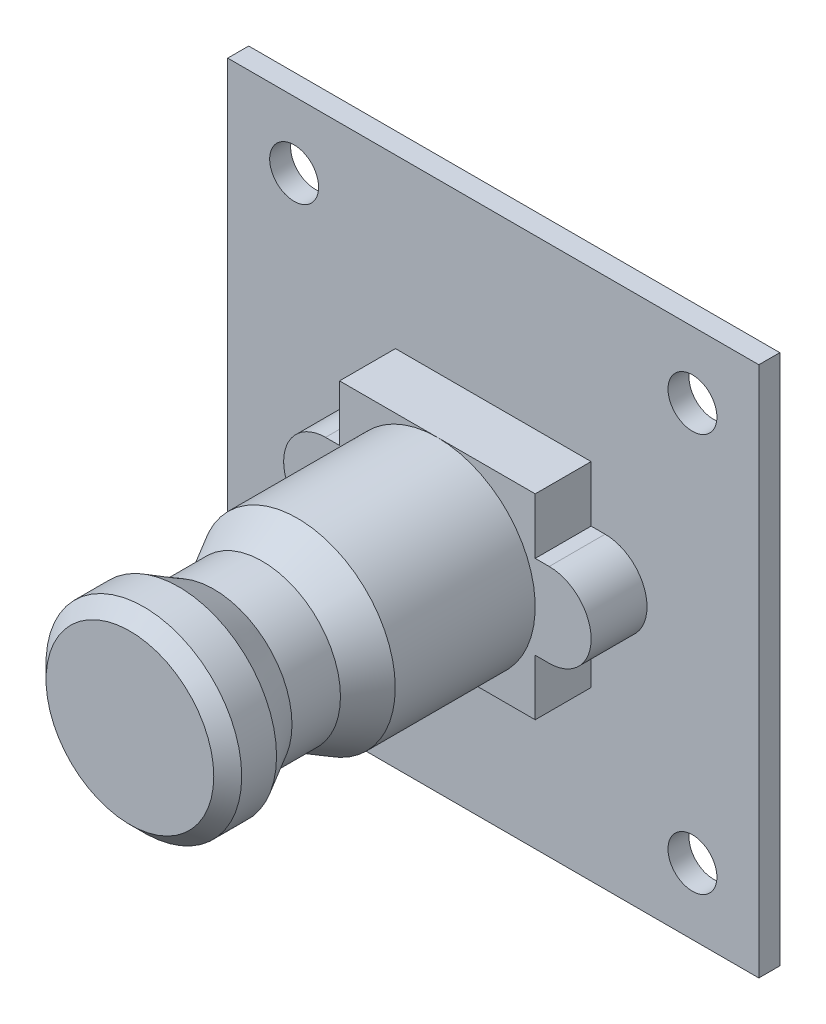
ISO-10303-21;
HEADER;
FILE_DESCRIPTION(('STEP AP214'),'2;1');
FILE_NAME('part.step','',(''),(''),'','','');
FILE_SCHEMA(('AUTOMOTIVE_DESIGN { 1 0 10303 214 1 1 1 1 }'));
ENDSEC;
DATA;
#1=APPLICATION_CONTEXT('core data for automotive mechanical design processes');
#2=APPLICATION_PROTOCOL_DEFINITION('international standard','automotive_design',2000,#1);
#3=PRODUCT_CONTEXT('',#1,'mechanical');
#4=PRODUCT('Part','Part','',(#3));
#5=PRODUCT_RELATED_PRODUCT_CATEGORY('part','',(#4));
#6=PRODUCT_DEFINITION_FORMATION('','',#4);
#7=PRODUCT_DEFINITION_CONTEXT('part definition',#1,'design');
#8=PRODUCT_DEFINITION('design','',#6,#7);
#9=PRODUCT_DEFINITION_SHAPE('','',#8);
#10=(LENGTH_UNIT() NAMED_UNIT(*) SI_UNIT(.MILLI.,.METRE.));
#11=(NAMED_UNIT(*) PLANE_ANGLE_UNIT() SI_UNIT($,.RADIAN.));
#12=(NAMED_UNIT(*) SI_UNIT($,.STERADIAN.) SOLID_ANGLE_UNIT());
#13=UNCERTAINTY_MEASURE_WITH_UNIT(LENGTH_MEASURE(1.E-05),#10,'distance_accuracy_value','');
#14=(GEOMETRIC_REPRESENTATION_CONTEXT(3) GLOBAL_UNCERTAINTY_ASSIGNED_CONTEXT((#13)) GLOBAL_UNIT_ASSIGNED_CONTEXT((#10,
#11,#12)) REPRESENTATION_CONTEXT('',''));
#15=CARTESIAN_POINT('',(0.,0.,0.));
#16=DIRECTION('',(0.,0.,1.));
#17=DIRECTION('',(1.,0.,0.));
#18=AXIS2_PLACEMENT_3D('',#15,#16,#17);
#19=CARTESIAN_POINT('',(0.,0.,0.));
#20=DIRECTION('',(0.,0.,1.));
#21=DIRECTION('',(1.,0.,0.));
#22=AXIS2_PLACEMENT_3D('',#19,#20,#21);
#23=PLANE('',#22);
#24=DIRECTION('',(0.,1.,0.));
#25=VECTOR('',#24,1.);
#26=CARTESIAN_POINT('',(19.,19.,0.));
#27=LINE('',#26,#25);
#28=CARTESIAN_POINT('',(19.,-19.,0.));
#29=VERTEX_POINT('',#28);
#30=CARTESIAN_POINT('',(19.,19.,0.));
#31=VERTEX_POINT('',#30);
#32=EDGE_CURVE('E329',#29,#31,#27,.T.);
#33=ORIENTED_EDGE('',*,*,#32,.F.);
#34=DIRECTION('',(1.,0.,0.));
#35=VECTOR('',#34,1.);
#36=CARTESIAN_POINT('',(-19.,-19.,0.));
#37=LINE('',#36,#35);
#38=CARTESIAN_POINT('',(-19.,-19.,0.));
#39=VERTEX_POINT('',#38);
#40=EDGE_CURVE('E334',#39,#29,#37,.T.);
#41=ORIENTED_EDGE('',*,*,#40,.F.);
#42=DIRECTION('',(0.,-1.,0.));
#43=VECTOR('',#42,1.);
#44=CARTESIAN_POINT('',(-19.,19.,0.));
#45=LINE('',#44,#43);
#46=CARTESIAN_POINT('',(-19.,19.,0.));
#47=VERTEX_POINT('',#46);
#48=EDGE_CURVE('E345',#47,#39,#45,.T.);
#49=ORIENTED_EDGE('',*,*,#48,.F.);
#50=DIRECTION('',(-1.,0.,0.));
#51=VECTOR('',#50,1.);
#52=CARTESIAN_POINT('',(-19.,19.,0.));
#53=LINE('',#52,#51);
#54=EDGE_CURVE('E343',#31,#47,#53,.T.);
#55=ORIENTED_EDGE('',*,*,#54,.F.);
#56=EDGE_LOOP('',(#33,#41,#49,#55));
#57=FACE_BOUND('',#56,.T.);
#58=CARTESIAN_POINT('',(-14.25,-14.25,0.));
#59=DIRECTION('',(0.,0.,1.));
#60=DIRECTION('',(1.,0.,0.));
#61=AXIS2_PLACEMENT_3D('',#58,#59,#60);
#62=CIRCLE('',#61,1.75);
#63=CARTESIAN_POINT('',(-12.5,-14.25,0.));
#64=VERTEX_POINT('',#63);
#65=EDGE_CURVE('E326',#64,#64,#62,.T.);
#66=ORIENTED_EDGE('',*,*,#65,.T.);
#67=EDGE_LOOP('',(#66));
#68=FACE_BOUND('',#67,.T.);
#69=CARTESIAN_POINT('',(14.25,-14.25,0.));
#70=DIRECTION('',(0.,0.,1.));
#71=DIRECTION('',(1.,0.,0.));
#72=AXIS2_PLACEMENT_3D('',#69,#70,#71);
#73=CIRCLE('',#72,1.75);
#74=CARTESIAN_POINT('',(16.,-14.25,0.));
#75=VERTEX_POINT('',#74);
#76=EDGE_CURVE('E320',#75,#75,#73,.T.);
#77=ORIENTED_EDGE('',*,*,#76,.T.);
#78=EDGE_LOOP('',(#77));
#79=FACE_BOUND('',#78,.T.);
#80=CARTESIAN_POINT('',(14.25,14.25,0.));
#81=DIRECTION('',(0.,0.,1.));
#82=DIRECTION('',(1.,0.,0.));
#83=AXIS2_PLACEMENT_3D('',#80,#81,#82);
#84=CIRCLE('',#83,1.75);
#85=CARTESIAN_POINT('',(16.,14.25,0.));
#86=VERTEX_POINT('',#85);
#87=EDGE_CURVE('E314',#86,#86,#84,.T.);
#88=ORIENTED_EDGE('',*,*,#87,.T.);
#89=EDGE_LOOP('',(#88));
#90=FACE_BOUND('',#89,.T.);
#91=CARTESIAN_POINT('',(-14.25,14.25,0.));
#92=DIRECTION('',(0.,0.,1.));
#93=DIRECTION('',(1.,0.,0.));
#94=AXIS2_PLACEMENT_3D('',#91,#92,#93);
#95=CIRCLE('',#94,1.75);
#96=CARTESIAN_POINT('',(-12.5,14.25,0.));
#97=VERTEX_POINT('',#96);
#98=EDGE_CURVE('E308',#97,#97,#95,.T.);
#99=ORIENTED_EDGE('',*,*,#98,.T.);
#100=EDGE_LOOP('',(#99));
#101=FACE_BOUND('',#100,.T.);
#102=DIRECTION('',(0.,1.,0.));
#103=VECTOR('',#102,1.);
#104=CARTESIAN_POINT('',(0.,-10.,0.));
#105=LINE('',#104,#103);
#106=CARTESIAN_POINT('',(0.,-16.,0.));
#107=VERTEX_POINT('',#106);
#108=CARTESIAN_POINT('',(0.,-10.,0.));
#109=VERTEX_POINT('',#108);
#110=EDGE_CURVE('E198',#107,#109,#105,.T.);
#111=ORIENTED_EDGE('',*,*,#110,.F.);
#112=DIRECTION('',(-1.,0.,0.));
#113=VECTOR('',#112,1.);
#114=CARTESIAN_POINT('',(10.,-16.,0.));
#115=LINE('',#114,#113);
#116=CARTESIAN_POINT('',(10.,-16.,0.));
#117=VERTEX_POINT('',#116);
#118=EDGE_CURVE('E195',#117,#107,#115,.T.);
#119=ORIENTED_EDGE('',*,*,#118,.F.);
#120=DIRECTION('',(0.,-1.,0.));
#121=VECTOR('',#120,1.);
#122=CARTESIAN_POINT('',(10.,-10.,0.));
#123=LINE('',#122,#121);
#124=CARTESIAN_POINT('',(10.,-10.,0.));
#125=VERTEX_POINT('',#124);
#126=EDGE_CURVE('E55',#125,#117,#123,.T.);
#127=ORIENTED_EDGE('',*,*,#126,.F.);
#128=DIRECTION('',(1.,0.,0.));
#129=VECTOR('',#128,1.);
#130=CARTESIAN_POINT('',(10.,-10.,0.));
#131=LINE('',#130,#129);
#132=EDGE_CURVE('E50',#109,#125,#131,.T.);
#133=ORIENTED_EDGE('',*,*,#132,.F.);
#134=EDGE_LOOP('',(#111,#119,#127,#133));
#135=FACE_BOUND('',#134,.T.);
#136=ADVANCED_FACE('F35',(#57,#68,#79,#90,#101,#135),#23,.F.);
#137=CARTESIAN_POINT('',(0.,0.,5.5));
#138=DIRECTION('',(0.,0.,1.));
#139=DIRECTION('',(1.,0.,0.));
#140=AXIS2_PLACEMENT_3D('',#137,#138,#139);
#141=PLANE('',#140);
#142=CARTESIAN_POINT('',(0.,0.,5.5));
#143=DIRECTION('',(0.,0.,1.));
#144=DIRECTION('',(1.,0.,0.));
#145=AXIS2_PLACEMENT_3D('',#142,#143,#144);
#146=CIRCLE('',#145,7.);
#147=CARTESIAN_POINT('',(0.,7.,5.5));
#148=VERTEX_POINT('',#147);
#149=CARTESIAN_POINT('',(0.,-7.,5.5));
#150=VERTEX_POINT('',#149);
#151=EDGE_CURVE('E216',#148,#150,#146,.T.);
#152=ORIENTED_EDGE('',*,*,#151,.F.);
#153=DIRECTION('',(-1.,0.,0.));
#154=VECTOR('',#153,1.);
#155=CARTESIAN_POINT('',(-7.,7.,5.5));
#156=LINE('',#155,#154);
#157=CARTESIAN_POINT('',(-7.,7.,5.5));
#158=VERTEX_POINT('',#157);
#159=EDGE_CURVE('E270',#148,#158,#156,.T.);
#160=ORIENTED_EDGE('',*,*,#159,.T.);
#161=DIRECTION('',(0.,-1.,0.));
#162=VECTOR('',#161,1.);
#163=CARTESIAN_POINT('',(-7.,7.,5.5));
#164=LINE('',#163,#162);
#165=CARTESIAN_POINT('',(-7.,3.,5.5));
#166=VERTEX_POINT('',#165);
#167=EDGE_CURVE('E275',#158,#166,#164,.T.);
#168=ORIENTED_EDGE('',*,*,#167,.T.);
#169=DIRECTION('',(-1.,0.,0.));
#170=VECTOR('',#169,1.);
#171=CARTESIAN_POINT('',(-8.,3.,5.5));
#172=LINE('',#171,#170);
#173=CARTESIAN_POINT('',(-8.,3.,5.5));
#174=VERTEX_POINT('',#173);
#175=EDGE_CURVE('E243',#166,#174,#172,.T.);
#176=ORIENTED_EDGE('',*,*,#175,.T.);
#177=CARTESIAN_POINT('',(-8.,0.,5.5));
#178=DIRECTION('',(0.,0.,1.));
#179=DIRECTION('',(1.,0.,0.));
#180=AXIS2_PLACEMENT_3D('',#177,#178,#179);
#181=CIRCLE('',#180,3.);
#182=CARTESIAN_POINT('',(-8.,-3.,5.5));
#183=VERTEX_POINT('',#182);
#184=EDGE_CURVE('E219',#174,#183,#181,.T.);
#185=ORIENTED_EDGE('',*,*,#184,.T.);
#186=DIRECTION('',(1.,0.,0.));
#187=VECTOR('',#186,1.);
#188=CARTESIAN_POINT('',(-8.,-3.,5.5));
#189=LINE('',#188,#187);
#190=CARTESIAN_POINT('',(-7.,-3.,5.5));
#191=VERTEX_POINT('',#190);
#192=EDGE_CURVE('E238',#183,#191,#189,.T.);
#193=ORIENTED_EDGE('',*,*,#192,.T.);
#194=CARTESIAN_POINT('',(-7.,-7.,5.5));
#195=VERTEX_POINT('',#194);
#196=EDGE_CURVE('E274',#191,#195,#164,.T.);
#197=ORIENTED_EDGE('',*,*,#196,.T.);
#198=DIRECTION('',(1.,0.,0.));
#199=VECTOR('',#198,1.);
#200=CARTESIAN_POINT('',(-7.,-7.,5.5));
#201=LINE('',#200,#199);
#202=EDGE_CURVE('E279',#195,#150,#201,.T.);
#203=ORIENTED_EDGE('',*,*,#202,.T.);
#204=EDGE_LOOP('',(#152,#160,#168,#176,#185,#193,#197,#203));
#205=FACE_BOUND('',#204,.T.);
#206=ADVANCED_FACE('F376',(#205),#141,.T.);
#207=CARTESIAN_POINT('',(7.,7.,5.5));
#208=DIRECTION('',(-1.,0.,0.));
#209=DIRECTION('',(0.,-1.,0.));
#210=AXIS2_PLACEMENT_3D('',#207,#208,#209);
#211=PLANE('',#210);
#212=DIRECTION('',(0.,1.,0.));
#213=VECTOR('',#212,1.);
#214=CARTESIAN_POINT('',(7.,7.,5.5));
#215=LINE('',#214,#213);
#216=CARTESIAN_POINT('',(7.,3.,5.5));
#217=VERTEX_POINT('',#216);
#218=CARTESIAN_POINT('',(7.,7.,5.5));
#219=VERTEX_POINT('',#218);
#220=EDGE_CURVE('E271',#217,#219,#215,.T.);
#221=ORIENTED_EDGE('',*,*,#220,.F.);
#222=DIRECTION('',(0.,0.,-1.));
#223=VECTOR('',#222,1.);
#224=CARTESIAN_POINT('',(7.,3.,5.5));
#225=LINE('',#224,#223);
#226=CARTESIAN_POINT('',(7.,3.,1.5));
#227=VERTEX_POINT('',#226);
#228=EDGE_CURVE('E263',#217,#227,#225,.T.);
#229=ORIENTED_EDGE('',*,*,#228,.T.);
#230=DIRECTION('',(0.,1.,0.));
#231=VECTOR('',#230,1.);
#232=CARTESIAN_POINT('',(7.,7.,1.5));
#233=LINE('',#232,#231);
#234=CARTESIAN_POINT('',(7.,7.,1.5));
#235=VERTEX_POINT('',#234);
#236=EDGE_CURVE('E266',#227,#235,#233,.T.);
#237=ORIENTED_EDGE('',*,*,#236,.T.);
#238=DIRECTION('',(0.,0.,-1.));
#239=VECTOR('',#238,1.);
#240=CARTESIAN_POINT('',(7.,7.,5.5));
#241=LINE('',#240,#239);
#242=EDGE_CURVE('E302',#219,#235,#241,.T.);
#243=ORIENTED_EDGE('',*,*,#242,.F.);
#244=EDGE_LOOP('',(#221,#229,#237,#243));
#245=FACE_BOUND('',#244,.T.);
#246=ADVANCED_FACE('F413',(#245),#211,.F.);
#247=CARTESIAN_POINT('',(-7.,7.,5.5));
#248=DIRECTION('',(1.,0.,0.));
#249=DIRECTION('',(0.,1.,0.));
#250=AXIS2_PLACEMENT_3D('',#247,#248,#249);
#251=PLANE('',#250);
#252=DIRECTION('',(0.,-1.,0.));
#253=VECTOR('',#252,1.);
#254=CARTESIAN_POINT('',(-7.,7.,1.5));
#255=LINE('',#254,#253);
#256=CARTESIAN_POINT('',(-7.,7.,1.5));
#257=VERTEX_POINT('',#256);
#258=CARTESIAN_POINT('',(-7.,3.,1.5));
#259=VERTEX_POINT('',#258);
#260=EDGE_CURVE('E289',#257,#259,#255,.T.);
#261=ORIENTED_EDGE('',*,*,#260,.T.);
#262=DIRECTION('',(0.,0.,1.));
#263=VECTOR('',#262,1.);
#264=CARTESIAN_POINT('',(-7.,3.,5.5));
#265=LINE('',#264,#263);
#266=EDGE_CURVE('E260',#259,#166,#265,.T.);
#267=ORIENTED_EDGE('',*,*,#266,.T.);
#268=ORIENTED_EDGE('',*,*,#167,.F.);
#269=DIRECTION('',(0.,0.,-1.));
#270=VECTOR('',#269,1.);
#271=CARTESIAN_POINT('',(-7.,7.,5.5));
#272=LINE('',#271,#270);
#273=EDGE_CURVE('E299',#158,#257,#272,.T.);
#274=ORIENTED_EDGE('',*,*,#273,.T.);
#275=EDGE_LOOP('',(#261,#267,#268,#274));
#276=FACE_BOUND('',#275,.T.);
#277=ADVANCED_FACE('F418',(#276),#251,.F.);
#278=CARTESIAN_POINT('',(0.,0.,1.5));
#279=DIRECTION('',(0.,0.,1.));
#280=DIRECTION('',(1.,0.,0.));
#281=AXIS2_PLACEMENT_3D('',#278,#279,#280);
#282=PLANE('',#281);
#283=DIRECTION('',(-1.,0.,0.));
#284=VECTOR('',#283,1.);
#285=CARTESIAN_POINT('',(-8.,3.,1.5));
#286=LINE('',#285,#284);
#287=CARTESIAN_POINT('',(-8.,3.,1.5));
#288=VERTEX_POINT('',#287);
#289=EDGE_CURVE('E231',#259,#288,#286,.T.);
#290=ORIENTED_EDGE('',*,*,#289,.F.);
#291=ORIENTED_EDGE('',*,*,#260,.F.);
#292=DIRECTION('',(-1.,0.,0.));
#293=VECTOR('',#292,1.);
#294=CARTESIAN_POINT('',(-7.,7.,1.5));
#295=LINE('',#294,#293);
#296=EDGE_CURVE('E286',#235,#257,#295,.T.);
#297=ORIENTED_EDGE('',*,*,#296,.F.);
#298=ORIENTED_EDGE('',*,*,#236,.F.);
#299=CARTESIAN_POINT('',(8.,3.,1.5));
#300=VERTEX_POINT('',#299);
#301=EDGE_CURVE('E232',#300,#227,#286,.T.);
#302=ORIENTED_EDGE('',*,*,#301,.F.);
#303=CARTESIAN_POINT('',(8.,0.,1.5));
#304=DIRECTION('',(0.,0.,1.));
#305=DIRECTION('',(1.,0.,0.));
#306=AXIS2_PLACEMENT_3D('',#303,#304,#305);
#307=CIRCLE('',#306,3.);
#308=CARTESIAN_POINT('',(8.,-3.,1.5));
#309=VERTEX_POINT('',#308);
#310=EDGE_CURVE('E228',#309,#300,#307,.T.);
#311=ORIENTED_EDGE('',*,*,#310,.F.);
#312=DIRECTION('',(1.,0.,0.));
#313=VECTOR('',#312,1.);
#314=CARTESIAN_POINT('',(-8.,-3.,1.5));
#315=LINE('',#314,#313);
#316=CARTESIAN_POINT('',(7.,-3.,1.5));
#317=VERTEX_POINT('',#316);
#318=EDGE_CURVE('E224',#317,#309,#315,.T.);
#319=ORIENTED_EDGE('',*,*,#318,.F.);
#320=CARTESIAN_POINT('',(7.,-7.,1.5));
#321=VERTEX_POINT('',#320);
#322=EDGE_CURVE('E283',#321,#317,#233,.T.);
#323=ORIENTED_EDGE('',*,*,#322,.F.);
#324=DIRECTION('',(1.,0.,0.));
#325=VECTOR('',#324,1.);
#326=CARTESIAN_POINT('',(-7.,-7.,1.5));
#327=LINE('',#326,#325);
#328=CARTESIAN_POINT('',(-7.,-7.,1.5));
#329=VERTEX_POINT('',#328);
#330=EDGE_CURVE('E292',#329,#321,#327,.T.);
#331=ORIENTED_EDGE('',*,*,#330,.F.);
#332=CARTESIAN_POINT('',(-7.,-3.,1.5));
#333=VERTEX_POINT('',#332);
#334=EDGE_CURVE('E288',#333,#329,#255,.T.);
#335=ORIENTED_EDGE('',*,*,#334,.F.);
#336=CARTESIAN_POINT('',(-8.,-3.,1.5));
#337=VERTEX_POINT('',#336);
#338=EDGE_CURVE('E226',#337,#333,#315,.T.);
#339=ORIENTED_EDGE('',*,*,#338,.F.);
#340=CARTESIAN_POINT('',(-8.,0.,1.5));
#341=DIRECTION('',(0.,0.,1.));
#342=DIRECTION('',(1.,0.,0.));
#343=AXIS2_PLACEMENT_3D('',#340,#341,#342);
#344=CIRCLE('',#343,3.);
#345=EDGE_CURVE('E221',#288,#337,#344,.T.);
#346=ORIENTED_EDGE('',*,*,#345,.F.);
#347=EDGE_LOOP('',(#290,#291,#297,#298,#302,#311,#319,#323,#331,#335,#339,#346));
#348=FACE_BOUND('',#347,.T.);
#349=CARTESIAN_POINT('',(-14.25,14.25,1.5));
#350=DIRECTION('',(0.,0.,1.));
#351=DIRECTION('',(1.,0.,0.));
#352=AXIS2_PLACEMENT_3D('',#349,#350,#351);
#353=CIRCLE('',#352,1.75);
#354=CARTESIAN_POINT('',(-12.5,14.25,1.5));
#355=VERTEX_POINT('',#354);
#356=EDGE_CURVE('E305',#355,#355,#353,.T.);
#357=ORIENTED_EDGE('',*,*,#356,.F.);
#358=EDGE_LOOP('',(#357));
#359=FACE_BOUND('',#358,.T.);
#360=CARTESIAN_POINT('',(14.25,14.25,1.5));
#361=DIRECTION('',(0.,0.,1.));
#362=DIRECTION('',(1.,0.,0.));
#363=AXIS2_PLACEMENT_3D('',#360,#361,#362);
#364=CIRCLE('',#363,1.75);
#365=CARTESIAN_POINT('',(16.,14.25,1.5));
#366=VERTEX_POINT('',#365);
#367=EDGE_CURVE('E311',#366,#366,#364,.T.);
#368=ORIENTED_EDGE('',*,*,#367,.F.);
#369=EDGE_LOOP('',(#368));
#370=FACE_BOUND('',#369,.T.);
#371=CARTESIAN_POINT('',(14.25,-14.25,1.5));
#372=DIRECTION('',(0.,0.,1.));
#373=DIRECTION('',(1.,0.,0.));
#374=AXIS2_PLACEMENT_3D('',#371,#372,#373);
#375=CIRCLE('',#374,1.75);
#376=CARTESIAN_POINT('',(16.,-14.25,1.5));
#377=VERTEX_POINT('',#376);
#378=EDGE_CURVE('E317',#377,#377,#375,.T.);
#379=ORIENTED_EDGE('',*,*,#378,.F.);
#380=EDGE_LOOP('',(#379));
#381=FACE_BOUND('',#380,.T.);
#382=CARTESIAN_POINT('',(-14.25,-14.25,1.5));
#383=DIRECTION('',(0.,0.,1.));
#384=DIRECTION('',(1.,0.,0.));
#385=AXIS2_PLACEMENT_3D('',#382,#383,#384);
#386=CIRCLE('',#385,1.75);
#387=CARTESIAN_POINT('',(-12.5,-14.25,1.5));
#388=VERTEX_POINT('',#387);
#389=EDGE_CURVE('E323',#388,#388,#386,.T.);
#390=ORIENTED_EDGE('',*,*,#389,.F.);
#391=EDGE_LOOP('',(#390));
#392=FACE_BOUND('',#391,.T.);
#393=DIRECTION('',(0.,1.,0.));
#394=VECTOR('',#393,1.);
#395=CARTESIAN_POINT('',(19.,19.,1.5));
#396=LINE('',#395,#394);
#397=CARTESIAN_POINT('',(19.,-19.,1.5));
#398=VERTEX_POINT('',#397);
#399=CARTESIAN_POINT('',(19.,19.,1.5));
#400=VERTEX_POINT('',#399);
#401=EDGE_CURVE('E330',#398,#400,#396,.T.);
#402=ORIENTED_EDGE('',*,*,#401,.T.);
#403=DIRECTION('',(-1.,0.,0.));
#404=VECTOR('',#403,1.);
#405=CARTESIAN_POINT('',(-19.,19.,1.5));
#406=LINE('',#405,#404);
#407=CARTESIAN_POINT('',(-19.,19.,1.5));
#408=VERTEX_POINT('',#407);
#409=EDGE_CURVE('E333',#400,#408,#406,.T.);
#410=ORIENTED_EDGE('',*,*,#409,.T.);
#411=DIRECTION('',(0.,-1.,0.));
#412=VECTOR('',#411,1.);
#413=CARTESIAN_POINT('',(-19.,19.,1.5));
#414=LINE('',#413,#412);
#415=CARTESIAN_POINT('',(-19.,-19.,1.5));
#416=VERTEX_POINT('',#415);
#417=EDGE_CURVE('E336',#408,#416,#414,.T.);
#418=ORIENTED_EDGE('',*,*,#417,.T.);
#419=DIRECTION('',(1.,0.,0.));
#420=VECTOR('',#419,1.);
#421=CARTESIAN_POINT('',(-19.,-19.,1.5));
#422=LINE('',#421,#420);
#423=EDGE_CURVE('E338',#416,#398,#422,.T.);
#424=ORIENTED_EDGE('',*,*,#423,.T.);
#425=EDGE_LOOP('',(#402,#410,#418,#424));
#426=FACE_BOUND('',#425,.T.);
#427=ADVANCED_FACE('F388',(#348,#359,#370,#381,#392,#426),#282,.T.);
#428=CARTESIAN_POINT('',(19.,19.,1.5));
#429=DIRECTION('',(-1.,0.,0.));
#430=DIRECTION('',(0.,-1.,0.));
#431=AXIS2_PLACEMENT_3D('',#428,#429,#430);
#432=PLANE('',#431);
#433=ORIENTED_EDGE('',*,*,#32,.T.);
#434=DIRECTION('',(0.,0.,-1.));
#435=VECTOR('',#434,1.);
#436=CARTESIAN_POINT('',(19.,19.,1.5));
#437=LINE('',#436,#435);
#438=EDGE_CURVE('E356',#400,#31,#437,.T.);
#439=ORIENTED_EDGE('',*,*,#438,.F.);
#440=ORIENTED_EDGE('',*,*,#401,.F.);
#441=DIRECTION('',(0.,0.,-1.));
#442=VECTOR('',#441,1.);
#443=CARTESIAN_POINT('',(19.,-19.,1.5));
#444=LINE('',#443,#442);
#445=EDGE_CURVE('E340',#398,#29,#444,.T.);
#446=ORIENTED_EDGE('',*,*,#445,.T.);
#447=EDGE_LOOP('',(#433,#439,#440,#446));
#448=FACE_BOUND('',#447,.T.);
#449=ADVANCED_FACE('F463',(#448),#432,.F.);
#450=CARTESIAN_POINT('',(-19.,19.,1.5));
#451=DIRECTION('',(0.,-1.,0.));
#452=DIRECTION('',(0.,0.,-1.));
#453=AXIS2_PLACEMENT_3D('',#450,#451,#452);
#454=PLANE('',#453);
#455=ORIENTED_EDGE('',*,*,#54,.T.);
#456=DIRECTION('',(0.,0.,-1.));
#457=VECTOR('',#456,1.);
#458=CARTESIAN_POINT('',(-19.,19.,1.5));
#459=LINE('',#458,#457);
#460=EDGE_CURVE('E353',#408,#47,#459,.T.);
#461=ORIENTED_EDGE('',*,*,#460,.F.);
#462=ORIENTED_EDGE('',*,*,#409,.F.);
#463=ORIENTED_EDGE('',*,*,#438,.T.);
#464=EDGE_LOOP('',(#455,#461,#462,#463));
#465=FACE_BOUND('',#464,.T.);
#466=ADVANCED_FACE('F460',(#465),#454,.F.);
#467=CARTESIAN_POINT('',(-19.,19.,1.5));
#468=DIRECTION('',(1.,0.,0.));
#469=DIRECTION('',(0.,0.,-1.));
#470=AXIS2_PLACEMENT_3D('',#467,#468,#469);
#471=PLANE('',#470);
#472=ORIENTED_EDGE('',*,*,#48,.T.);
#473=DIRECTION('',(0.,0.,-1.));
#474=VECTOR('',#473,1.);
#475=CARTESIAN_POINT('',(-19.,-19.,1.5));
#476=LINE('',#475,#474);
#477=EDGE_CURVE('E350',#416,#39,#476,.T.);
#478=ORIENTED_EDGE('',*,*,#477,.F.);
#479=ORIENTED_EDGE('',*,*,#417,.F.);
#480=ORIENTED_EDGE('',*,*,#460,.T.);
#481=EDGE_LOOP('',(#472,#478,#479,#480));
#482=FACE_BOUND('',#481,.T.);
#483=ADVANCED_FACE('F456',(#482),#471,.F.);
#484=CARTESIAN_POINT('',(-19.,-19.,1.5));
#485=DIRECTION('',(0.,1.,0.));
#486=DIRECTION('',(0.,0.,1.));
#487=AXIS2_PLACEMENT_3D('',#484,#485,#486);
#488=PLANE('',#487);
#489=ORIENTED_EDGE('',*,*,#40,.T.);
#490=ORIENTED_EDGE('',*,*,#445,.F.);
#491=ORIENTED_EDGE('',*,*,#423,.F.);
#492=ORIENTED_EDGE('',*,*,#477,.T.);
#493=EDGE_LOOP('',(#489,#490,#491,#492));
#494=FACE_BOUND('',#493,.T.);
#495=ADVANCED_FACE('F452',(#494),#488,.F.);
#496=CARTESIAN_POINT('',(-14.25,-14.25,1.5));
#497=DIRECTION('',(0.,0.,1.));
#498=DIRECTION('',(1.,0.,0.));
#499=AXIS2_PLACEMENT_3D('',#496,#497,#498);
#500=CYLINDRICAL_SURFACE('',#499,1.75);
#501=ORIENTED_EDGE('',*,*,#389,.T.);
#502=EDGE_LOOP('',(#501));
#503=FACE_BOUND('',#502,.T.);
#504=ORIENTED_EDGE('',*,*,#65,.F.);
#505=EDGE_LOOP('',(#504));
#506=FACE_BOUND('',#505,.T.);
#507=ADVANCED_FACE('F455',(#503,#506),#500,.F.);
#508=CARTESIAN_POINT('',(14.25,-14.25,1.5));
#509=DIRECTION('',(0.,0.,1.));
#510=DIRECTION('',(1.,0.,0.));
#511=AXIS2_PLACEMENT_3D('',#508,#509,#510);
#512=CYLINDRICAL_SURFACE('',#511,1.75);
#513=ORIENTED_EDGE('',*,*,#378,.T.);
#514=EDGE_LOOP('',(#513));
#515=FACE_BOUND('',#514,.T.);
#516=ORIENTED_EDGE('',*,*,#76,.F.);
#517=EDGE_LOOP('',(#516));
#518=FACE_BOUND('',#517,.T.);
#519=ADVANCED_FACE('F506',(#515,#518),#512,.F.);
#520=CARTESIAN_POINT('',(14.25,14.25,1.5));
#521=DIRECTION('',(0.,0.,1.));
#522=DIRECTION('',(1.,0.,0.));
#523=AXIS2_PLACEMENT_3D('',#520,#521,#522);
#524=CYLINDRICAL_SURFACE('',#523,1.75);
#525=ORIENTED_EDGE('',*,*,#367,.T.);
#526=EDGE_LOOP('',(#525));
#527=FACE_BOUND('',#526,.T.);
#528=ORIENTED_EDGE('',*,*,#87,.F.);
#529=EDGE_LOOP('',(#528));
#530=FACE_BOUND('',#529,.T.);
#531=ADVANCED_FACE('F502',(#527,#530),#524,.F.);
#532=CARTESIAN_POINT('',(-14.25,14.25,1.5));
#533=DIRECTION('',(0.,0.,1.));
#534=DIRECTION('',(1.,0.,0.));
#535=AXIS2_PLACEMENT_3D('',#532,#533,#534);
#536=CYLINDRICAL_SURFACE('',#535,1.75);
#537=ORIENTED_EDGE('',*,*,#356,.T.);
#538=EDGE_LOOP('',(#537));
#539=FACE_BOUND('',#538,.T.);
#540=ORIENTED_EDGE('',*,*,#98,.F.);
#541=EDGE_LOOP('',(#540));
#542=FACE_BOUND('',#541,.T.);
#543=ADVANCED_FACE('F498',(#539,#542),#536,.F.);
#544=ORIENTED_EDGE('',*,*,#322,.T.);
#545=DIRECTION('',(0.,0.,1.));
#546=VECTOR('',#545,1.);
#547=CARTESIAN_POINT('',(7.,-3.,5.5));
#548=LINE('',#547,#546);
#549=CARTESIAN_POINT('',(7.,-3.,5.5));
#550=VERTEX_POINT('',#549);
#551=EDGE_CURVE('E257',#317,#550,#548,.T.);
#552=ORIENTED_EDGE('',*,*,#551,.T.);
#553=CARTESIAN_POINT('',(7.,-7.,5.5));
#554=VERTEX_POINT('',#553);
#555=EDGE_CURVE('E267',#554,#550,#215,.T.);
#556=ORIENTED_EDGE('',*,*,#555,.F.);
#557=DIRECTION('',(0.,0.,-1.));
#558=VECTOR('',#557,1.);
#559=CARTESIAN_POINT('',(7.,-7.,5.5));
#560=LINE('',#559,#558);
#561=EDGE_CURVE('E282',#554,#321,#560,.T.);
#562=ORIENTED_EDGE('',*,*,#561,.T.);
#563=EDGE_LOOP('',(#544,#552,#556,#562));
#564=FACE_BOUND('',#563,.T.);
#565=ADVANCED_FACE('F394',(#564),#211,.F.);
#566=CARTESIAN_POINT('',(-7.,7.,5.5));
#567=DIRECTION('',(0.,-1.,0.));
#568=DIRECTION('',(0.,0.,-1.));
#569=AXIS2_PLACEMENT_3D('',#566,#567,#568);
#570=PLANE('',#569);
#571=ORIENTED_EDGE('',*,*,#296,.T.);
#572=ORIENTED_EDGE('',*,*,#273,.F.);
#573=ORIENTED_EDGE('',*,*,#159,.F.);
#574=EDGE_CURVE('E272',#219,#148,#156,.T.);
#575=ORIENTED_EDGE('',*,*,#574,.F.);
#576=ORIENTED_EDGE('',*,*,#242,.T.);
#577=EDGE_LOOP('',(#571,#572,#573,#575,#576));
#578=FACE_BOUND('',#577,.T.);
#579=ADVANCED_FACE('F410',(#578),#570,.F.);
#580=ORIENTED_EDGE('',*,*,#196,.F.);
#581=DIRECTION('',(0.,0.,-1.));
#582=VECTOR('',#581,1.);
#583=CARTESIAN_POINT('',(-7.,-3.,5.5));
#584=LINE('',#583,#582);
#585=EDGE_CURVE('E248',#191,#333,#584,.T.);
#586=ORIENTED_EDGE('',*,*,#585,.T.);
#587=ORIENTED_EDGE('',*,*,#334,.T.);
#588=DIRECTION('',(0.,0.,-1.));
#589=VECTOR('',#588,1.);
#590=CARTESIAN_POINT('',(-7.,-7.,5.5));
#591=LINE('',#590,#589);
#592=EDGE_CURVE('E296',#195,#329,#591,.T.);
#593=ORIENTED_EDGE('',*,*,#592,.F.);
#594=EDGE_LOOP('',(#580,#586,#587,#593));
#595=FACE_BOUND('',#594,.T.);
#596=ADVANCED_FACE('F382',(#595),#251,.F.);
#597=CARTESIAN_POINT('',(-7.,-7.,5.5));
#598=DIRECTION('',(0.,1.,0.));
#599=DIRECTION('',(0.,0.,1.));
#600=AXIS2_PLACEMENT_3D('',#597,#598,#599);
#601=PLANE('',#600);
#602=ORIENTED_EDGE('',*,*,#330,.T.);
#603=ORIENTED_EDGE('',*,*,#561,.F.);
#604=EDGE_CURVE('E278',#150,#554,#201,.T.);
#605=ORIENTED_EDGE('',*,*,#604,.F.);
#606=ORIENTED_EDGE('',*,*,#202,.F.);
#607=ORIENTED_EDGE('',*,*,#592,.T.);
#608=EDGE_LOOP('',(#602,#603,#605,#606,#607));
#609=FACE_BOUND('',#608,.T.);
#610=ADVANCED_FACE('F373',(#609),#601,.F.);
#611=EDGE_CURVE('E220',#150,#148,#146,.T.);
#612=ORIENTED_EDGE('',*,*,#611,.F.);
#613=ORIENTED_EDGE('',*,*,#604,.T.);
#614=ORIENTED_EDGE('',*,*,#555,.T.);
#615=CARTESIAN_POINT('',(8.,-3.,5.5));
#616=VERTEX_POINT('',#615);
#617=EDGE_CURVE('E237',#550,#616,#189,.T.);
#618=ORIENTED_EDGE('',*,*,#617,.T.);
#619=CARTESIAN_POINT('',(8.,0.,5.5));
#620=DIRECTION('',(0.,0.,1.));
#621=DIRECTION('',(1.,0.,0.));
#622=AXIS2_PLACEMENT_3D('',#619,#620,#621);
#623=CIRCLE('',#622,3.);
#624=CARTESIAN_POINT('',(8.,3.,5.5));
#625=VERTEX_POINT('',#624);
#626=EDGE_CURVE('E240',#616,#625,#623,.T.);
#627=ORIENTED_EDGE('',*,*,#626,.T.);
#628=EDGE_CURVE('E225',#625,#217,#172,.T.);
#629=ORIENTED_EDGE('',*,*,#628,.T.);
#630=ORIENTED_EDGE('',*,*,#220,.T.);
#631=ORIENTED_EDGE('',*,*,#574,.T.);
#632=EDGE_LOOP('',(#612,#613,#614,#618,#627,#629,#630,#631));
#633=FACE_BOUND('',#632,.T.);
#634=ADVANCED_FACE('F367',(#633),#141,.T.);
#635=CARTESIAN_POINT('',(-8.,-3.,1.5));
#636=DIRECTION('',(0.,-1.,0.));
#637=DIRECTION('',(0.,0.,-1.));
#638=AXIS2_PLACEMENT_3D('',#635,#636,#637);
#639=PLANE('',#638);
#640=ORIENTED_EDGE('',*,*,#585,.F.);
#641=ORIENTED_EDGE('',*,*,#192,.F.);
#642=DIRECTION('',(0.,0.,1.));
#643=VECTOR('',#642,1.);
#644=CARTESIAN_POINT('',(-8.,-3.,1.5));
#645=LINE('',#644,#643);
#646=EDGE_CURVE('E234',#337,#183,#645,.T.);
#647=ORIENTED_EDGE('',*,*,#646,.F.);
#648=ORIENTED_EDGE('',*,*,#338,.T.);
#649=EDGE_LOOP('',(#640,#641,#647,#648));
#650=FACE_BOUND('',#649,.T.);
#651=ADVANCED_FACE('F427',(#650),#639,.T.);
#652=CARTESIAN_POINT('',(-8.,3.,1.5));
#653=DIRECTION('',(0.,1.,0.));
#654=DIRECTION('',(0.,0.,1.));
#655=AXIS2_PLACEMENT_3D('',#652,#653,#654);
#656=PLANE('',#655);
#657=ORIENTED_EDGE('',*,*,#266,.F.);
#658=ORIENTED_EDGE('',*,*,#289,.T.);
#659=DIRECTION('',(0.,0.,1.));
#660=VECTOR('',#659,1.);
#661=CARTESIAN_POINT('',(-8.,3.,1.5));
#662=LINE('',#661,#660);
#663=EDGE_CURVE('E245',#288,#174,#662,.T.);
#664=ORIENTED_EDGE('',*,*,#663,.T.);
#665=ORIENTED_EDGE('',*,*,#175,.F.);
#666=EDGE_LOOP('',(#657,#658,#664,#665));
#667=FACE_BOUND('',#666,.T.);
#668=ADVANCED_FACE('F422',(#667),#656,.T.);
#669=CARTESIAN_POINT('',(-8.,0.,1.5));
#670=DIRECTION('',(0.,0.,1.));
#671=DIRECTION('',(1.,0.,0.));
#672=AXIS2_PLACEMENT_3D('',#669,#670,#671);
#673=CYLINDRICAL_SURFACE('',#672,3.);
#674=ORIENTED_EDGE('',*,*,#184,.F.);
#675=ORIENTED_EDGE('',*,*,#663,.F.);
#676=ORIENTED_EDGE('',*,*,#345,.T.);
#677=ORIENTED_EDGE('',*,*,#646,.T.);
#678=EDGE_LOOP('',(#674,#675,#676,#677));
#679=FACE_BOUND('',#678,.T.);
#680=ADVANCED_FACE('F425',(#679),#673,.T.);
#681=ORIENTED_EDGE('',*,*,#228,.F.);
#682=ORIENTED_EDGE('',*,*,#628,.F.);
#683=DIRECTION('',(0.,0.,1.));
#684=VECTOR('',#683,1.);
#685=CARTESIAN_POINT('',(8.,3.,1.5));
#686=LINE('',#685,#684);
#687=EDGE_CURVE('E249',#300,#625,#686,.T.);
#688=ORIENTED_EDGE('',*,*,#687,.F.);
#689=ORIENTED_EDGE('',*,*,#301,.T.);
#690=EDGE_LOOP('',(#681,#682,#688,#689));
#691=FACE_BOUND('',#690,.T.);
#692=ADVANCED_FACE('F405',(#691),#656,.T.);
#693=ORIENTED_EDGE('',*,*,#551,.F.);
#694=ORIENTED_EDGE('',*,*,#318,.T.);
#695=DIRECTION('',(0.,0.,1.));
#696=VECTOR('',#695,1.);
#697=CARTESIAN_POINT('',(8.,-3.,1.5));
#698=LINE('',#697,#696);
#699=EDGE_CURVE('E251',#309,#616,#698,.T.);
#700=ORIENTED_EDGE('',*,*,#699,.T.);
#701=ORIENTED_EDGE('',*,*,#617,.F.);
#702=EDGE_LOOP('',(#693,#694,#700,#701));
#703=FACE_BOUND('',#702,.T.);
#704=ADVANCED_FACE('F399',(#703),#639,.T.);
#705=CARTESIAN_POINT('',(8.,0.,1.5));
#706=DIRECTION('',(0.,0.,1.));
#707=DIRECTION('',(1.,0.,0.));
#708=AXIS2_PLACEMENT_3D('',#705,#706,#707);
#709=CYLINDRICAL_SURFACE('',#708,3.);
#710=ORIENTED_EDGE('',*,*,#626,.F.);
#711=ORIENTED_EDGE('',*,*,#699,.F.);
#712=ORIENTED_EDGE('',*,*,#310,.T.);
#713=ORIENTED_EDGE('',*,*,#687,.T.);
#714=EDGE_LOOP('',(#710,#711,#712,#713));
#715=FACE_BOUND('',#714,.T.);
#716=ADVANCED_FACE('F401',(#715),#709,.T.);
#717=CARTESIAN_POINT('',(0.,0.,27.5));
#718=DIRECTION('',(0.,0.,-1.));
#719=DIRECTION('',(-1.,0.,0.));
#720=AXIS2_PLACEMENT_3D('',#717,#718,#719);
#721=CYLINDRICAL_SURFACE('',#720,7.);
#722=CARTESIAN_POINT('',(0.,0.,15.5142190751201));
#723=DIRECTION('',(0.,0.,1.));
#724=DIRECTION('',(1.,0.,0.));
#725=AXIS2_PLACEMENT_3D('',#722,#723,#724);
#726=CIRCLE('',#725,7.);
#727=CARTESIAN_POINT('',(7.,0.,15.5142190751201));
#728=VERTEX_POINT('',#727);
#729=EDGE_CURVE('E199',#728,#728,#726,.T.);
#730=ORIENTED_EDGE('',*,*,#729,.F.);
#731=EDGE_LOOP('',(#730));
#732=FACE_BOUND('',#731,.T.);
#733=ORIENTED_EDGE('',*,*,#151,.T.);
#734=ORIENTED_EDGE('',*,*,#611,.T.);
#735=EDGE_LOOP('',(#733,#734));
#736=FACE_BOUND('',#735,.T.);
#737=ADVANCED_FACE('F363',(#732,#736),#721,.T.);
#738=CARTESIAN_POINT('',(0.,0.,21.4946227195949));
#739=DIRECTION('',(0.,0.,1.));
#740=DIRECTION('',(1.,0.,0.));
#741=AXIS2_PLACEMENT_3D('',#738,#739,#740);
#742=CONICAL_SURFACE('',#741,5.59167740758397,0.511012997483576);
#743=CARTESIAN_POINT('',(0.,0.,24.0063922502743));
#744=DIRECTION('',(0.,0.,1.));
#745=DIRECTION('',(1.,0.,0.));
#746=AXIS2_PLACEMENT_3D('',#743,#744,#745);
#747=CIRCLE('',#746,7.);
#748=CARTESIAN_POINT('',(7.,0.,24.0063922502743));
#749=VERTEX_POINT('',#748);
#750=EDGE_CURVE('E213',#749,#749,#747,.T.);
#751=ORIENTED_EDGE('',*,*,#750,.F.);
#752=EDGE_LOOP('',(#751));
#753=FACE_BOUND('',#752,.T.);
#754=CARTESIAN_POINT('',(0.,0.,21.4946227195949));
#755=DIRECTION('',(0.,0.,1.));
#756=DIRECTION('',(1.,0.,0.));
#757=AXIS2_PLACEMENT_3D('',#754,#755,#756);
#758=CIRCLE('',#757,5.59167740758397);
#759=CARTESIAN_POINT('',(5.59167740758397,0.,21.4946227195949));
#760=VERTEX_POINT('',#759);
#761=EDGE_CURVE('E210',#760,#760,#758,.T.);
#762=ORIENTED_EDGE('',*,*,#761,.T.);
#763=EDGE_LOOP('',(#762));
#764=FACE_BOUND('',#763,.T.);
#765=ADVANCED_FACE('F559',(#753,#764),#742,.T.);
#766=CARTESIAN_POINT('',(0.,0.,26.5));
#767=DIRECTION('',(0.,0.,1.));
#768=DIRECTION('',(1.,0.,0.));
#769=AXIS2_PLACEMENT_3D('',#766,#767,#768);
#770=CYLINDRICAL_SURFACE('',#769,5.59167740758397);
#771=ORIENTED_EDGE('',*,*,#761,.F.);
#772=EDGE_LOOP('',(#771));
#773=FACE_BOUND('',#772,.T.);
#774=CARTESIAN_POINT('',(0.,0.,18.0259886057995));
#775=DIRECTION('',(0.,0.,1.));
#776=DIRECTION('',(1.,0.,0.));
#777=AXIS2_PLACEMENT_3D('',#774,#775,#776);
#778=CIRCLE('',#777,5.59167740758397);
#779=CARTESIAN_POINT('',(5.59167740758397,0.,18.0259886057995));
#780=VERTEX_POINT('',#779);
#781=EDGE_CURVE('E202',#780,#780,#778,.T.);
#782=ORIENTED_EDGE('',*,*,#781,.T.);
#783=EDGE_LOOP('',(#782));
#784=FACE_BOUND('',#783,.T.);
#785=ADVANCED_FACE('F555',(#773,#784),#770,.T.);
#786=CARTESIAN_POINT('',(0.,0.,15.5142190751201));
#787=DIRECTION('',(0.,0.,-1.));
#788=DIRECTION('',(-1.,0.,0.));
#789=AXIS2_PLACEMENT_3D('',#786,#787,#788);
#790=CONICAL_SURFACE('',#789,7.,0.511012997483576);
#791=ORIENTED_EDGE('',*,*,#781,.F.);
#792=EDGE_LOOP('',(#791));
#793=FACE_BOUND('',#792,.T.);
#794=ORIENTED_EDGE('',*,*,#729,.T.);
#795=EDGE_LOOP('',(#794));
#796=FACE_BOUND('',#795,.T.);
#797=ADVANCED_FACE('F551',(#793,#796),#790,.T.);
#798=CARTESIAN_POINT('',(0.,0.,27.5));
#799=DIRECTION('',(0.,0.,1.));
#800=DIRECTION('',(1.,0.,0.));
#801=AXIS2_PLACEMENT_3D('',#798,#799,#800);
#802=PLANE('',#801);
#803=CARTESIAN_POINT('',(0.,0.,27.5));
#804=DIRECTION('',(0.,0.,1.));
#805=DIRECTION('',(1.,0.,0.));
#806=AXIS2_PLACEMENT_3D('',#803,#804,#805);
#807=CIRCLE('',#806,6.00000000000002);
#808=CARTESIAN_POINT('',(6.00000000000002,0.,27.5));
#809=VERTEX_POINT('',#808);
#810=EDGE_CURVE('E43',#809,#809,#807,.T.);
#811=ORIENTED_EDGE('',*,*,#810,.T.);
#812=EDGE_LOOP('',(#811));
#813=FACE_BOUND('',#812,.T.);
#814=ADVANCED_FACE('F554',(#813),#802,.T.);
#815=CARTESIAN_POINT('',(0.,0.,27.5));
#816=DIRECTION('',(0.,0.,-1.));
#817=DIRECTION('',(-1.,0.,0.));
#818=AXIS2_PLACEMENT_3D('',#815,#816,#817);
#819=CONICAL_SURFACE('',#818,6.00000000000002,0.785398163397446);
#820=CARTESIAN_POINT('',(0.,0.,26.5));
#821=DIRECTION('',(0.,0.,1.));
#822=DIRECTION('',(1.,0.,0.));
#823=AXIS2_PLACEMENT_3D('',#820,#821,#822);
#824=CIRCLE('',#823,7.);
#825=CARTESIAN_POINT('',(7.,0.,26.5));
#826=VERTEX_POINT('',#825);
#827=EDGE_CURVE('E11',#826,#826,#824,.F.);
#828=ORIENTED_EDGE('',*,*,#827,.F.);
#829=EDGE_LOOP('',(#828));
#830=FACE_BOUND('',#829,.T.);
#831=ORIENTED_EDGE('',*,*,#810,.F.);
#832=EDGE_LOOP('',(#831));
#833=FACE_BOUND('',#832,.T.);
#834=ADVANCED_FACE('F37',(#830,#833),#819,.T.);
#835=ORIENTED_EDGE('',*,*,#750,.T.);
#836=EDGE_LOOP('',(#835));
#837=FACE_BOUND('',#836,.T.);
#838=ORIENTED_EDGE('',*,*,#827,.T.);
#839=EDGE_LOOP('',(#838));
#840=FACE_BOUND('',#839,.T.);
#841=ADVANCED_FACE('F550',(#837,#840),#721,.T.);
#842=CARTESIAN_POINT('',(0.,-10.,-6.));
#843=DIRECTION('',(1.,0.,0.));
#844=DIRECTION('',(0.,1.,0.));
#845=AXIS2_PLACEMENT_3D('',#842,#843,#844);
#846=PLANE('',#845);
#847=ORIENTED_EDGE('',*,*,#110,.T.);
#848=DIRECTION('',(0.,0.,1.));
#849=VECTOR('',#848,1.);
#850=CARTESIAN_POINT('',(0.,-10.,-6.));
#851=LINE('',#850,#849);
#852=CARTESIAN_POINT('',(0.,-10.,-6.));
#853=VERTEX_POINT('',#852);
#854=EDGE_CURVE('E179',#853,#109,#851,.T.);
#855=ORIENTED_EDGE('',*,*,#854,.F.);
#856=DIRECTION('',(0.,1.,0.));
#857=VECTOR('',#856,1.);
#858=CARTESIAN_POINT('',(0.,-10.,-6.));
#859=LINE('',#858,#857);
#860=CARTESIAN_POINT('',(0.,-16.,-6.));
#861=VERTEX_POINT('',#860);
#862=EDGE_CURVE('E186',#861,#853,#859,.T.);
#863=ORIENTED_EDGE('',*,*,#862,.F.);
#864=DIRECTION('',(0.,0.,1.));
#865=VECTOR('',#864,1.);
#866=CARTESIAN_POINT('',(0.,-16.,-6.));
#867=LINE('',#866,#865);
#868=EDGE_CURVE('E528',#861,#107,#867,.T.);
#869=ORIENTED_EDGE('',*,*,#868,.T.);
#870=EDGE_LOOP('',(#847,#855,#863,#869));
#871=FACE_BOUND('',#870,.T.);
#872=ADVANCED_FACE('F197',(#871),#846,.F.);
#873=CARTESIAN_POINT('',(10.,-10.,-6.));
#874=DIRECTION('',(0.,-1.,0.));
#875=DIRECTION('',(1.,0.,0.));
#876=AXIS2_PLACEMENT_3D('',#873,#874,#875);
#877=PLANE('',#876);
#878=ORIENTED_EDGE('',*,*,#132,.T.);
#879=DIRECTION('',(0.,0.,1.));
#880=VECTOR('',#879,1.);
#881=CARTESIAN_POINT('',(10.,-10.,-6.));
#882=LINE('',#881,#880);
#883=CARTESIAN_POINT('',(10.,-10.,-6.));
#884=VERTEX_POINT('',#883);
#885=EDGE_CURVE('E182',#884,#125,#882,.T.);
#886=ORIENTED_EDGE('',*,*,#885,.F.);
#887=DIRECTION('',(1.,0.,0.));
#888=VECTOR('',#887,1.);
#889=CARTESIAN_POINT('',(10.,-10.,-6.));
#890=LINE('',#889,#888);
#891=EDGE_CURVE('E175',#853,#884,#890,.T.);
#892=ORIENTED_EDGE('',*,*,#891,.F.);
#893=ORIENTED_EDGE('',*,*,#854,.T.);
#894=EDGE_LOOP('',(#878,#886,#892,#893));
#895=FACE_BOUND('',#894,.T.);
#896=ADVANCED_FACE('F177',(#895),#877,.F.);
#897=CARTESIAN_POINT('',(10.,-10.,-6.));
#898=DIRECTION('',(-1.,0.,0.));
#899=DIRECTION('',(0.,0.,1.));
#900=AXIS2_PLACEMENT_3D('',#897,#898,#899);
#901=PLANE('',#900);
#902=ORIENTED_EDGE('',*,*,#126,.T.);
#903=DIRECTION('',(0.,0.,1.));
#904=VECTOR('',#903,1.);
#905=CARTESIAN_POINT('',(10.,-16.,-6.));
#906=LINE('',#905,#904);
#907=CARTESIAN_POINT('',(10.,-16.,-6.));
#908=VERTEX_POINT('',#907);
#909=EDGE_CURVE('E204',#908,#117,#906,.T.);
#910=ORIENTED_EDGE('',*,*,#909,.F.);
#911=DIRECTION('',(0.,-1.,0.));
#912=VECTOR('',#911,1.);
#913=CARTESIAN_POINT('',(10.,-10.,-6.));
#914=LINE('',#913,#912);
#915=EDGE_CURVE('E185',#884,#908,#914,.T.);
#916=ORIENTED_EDGE('',*,*,#915,.F.);
#917=ORIENTED_EDGE('',*,*,#885,.T.);
#918=EDGE_LOOP('',(#902,#910,#916,#917));
#919=FACE_BOUND('',#918,.T.);
#920=ADVANCED_FACE('F537',(#919),#901,.F.);
#921=CARTESIAN_POINT('',(10.,-16.,-6.));
#922=DIRECTION('',(0.,1.,0.));
#923=DIRECTION('',(0.,0.,1.));
#924=AXIS2_PLACEMENT_3D('',#921,#922,#923);
#925=PLANE('',#924);
#926=ORIENTED_EDGE('',*,*,#118,.T.);
#927=ORIENTED_EDGE('',*,*,#868,.F.);
#928=DIRECTION('',(-1.,0.,0.));
#929=VECTOR('',#928,1.);
#930=CARTESIAN_POINT('',(10.,-16.,-6.));
#931=LINE('',#930,#929);
#932=EDGE_CURVE('E191',#908,#861,#931,.T.);
#933=ORIENTED_EDGE('',*,*,#932,.F.);
#934=ORIENTED_EDGE('',*,*,#909,.T.);
#935=EDGE_LOOP('',(#926,#927,#933,#934));
#936=FACE_BOUND('',#935,.T.);
#937=ADVANCED_FACE('F527',(#936),#925,.F.);
#938=CARTESIAN_POINT('',(0.,0.,-6.));
#939=DIRECTION('',(0.,0.,-1.));
#940=DIRECTION('',(-1.,0.,0.));
#941=AXIS2_PLACEMENT_3D('',#938,#939,#940);
#942=PLANE('',#941);
#943=ORIENTED_EDGE('',*,*,#862,.T.);
#944=ORIENTED_EDGE('',*,*,#891,.T.);
#945=ORIENTED_EDGE('',*,*,#915,.T.);
#946=ORIENTED_EDGE('',*,*,#932,.T.);
#947=EDGE_LOOP('',(#943,#944,#945,#946));
#948=FACE_BOUND('',#947,.T.);
#949=ADVANCED_FACE('F189',(#948),#942,.T.);
#950=CLOSED_SHELL('',(#136,#206,#246,#277,#427,#449,#466,#483,#495,#507,#519,#531,#543,#565,
#579,#596,#610,#634,#651,#668,#680,#692,#704,#716,#737,#765,#785,#797,#814,#834,#841,#872,#896,
#920,#937,#949));
#951=MANIFOLD_SOLID_BREP('B2',#950);
#952=ADVANCED_BREP_SHAPE_REPRESENTATION('',(#18,#951),#14);
#953=SHAPE_DEFINITION_REPRESENTATION(#9,#952);
ENDSEC;
END-ISO-10303-21;
